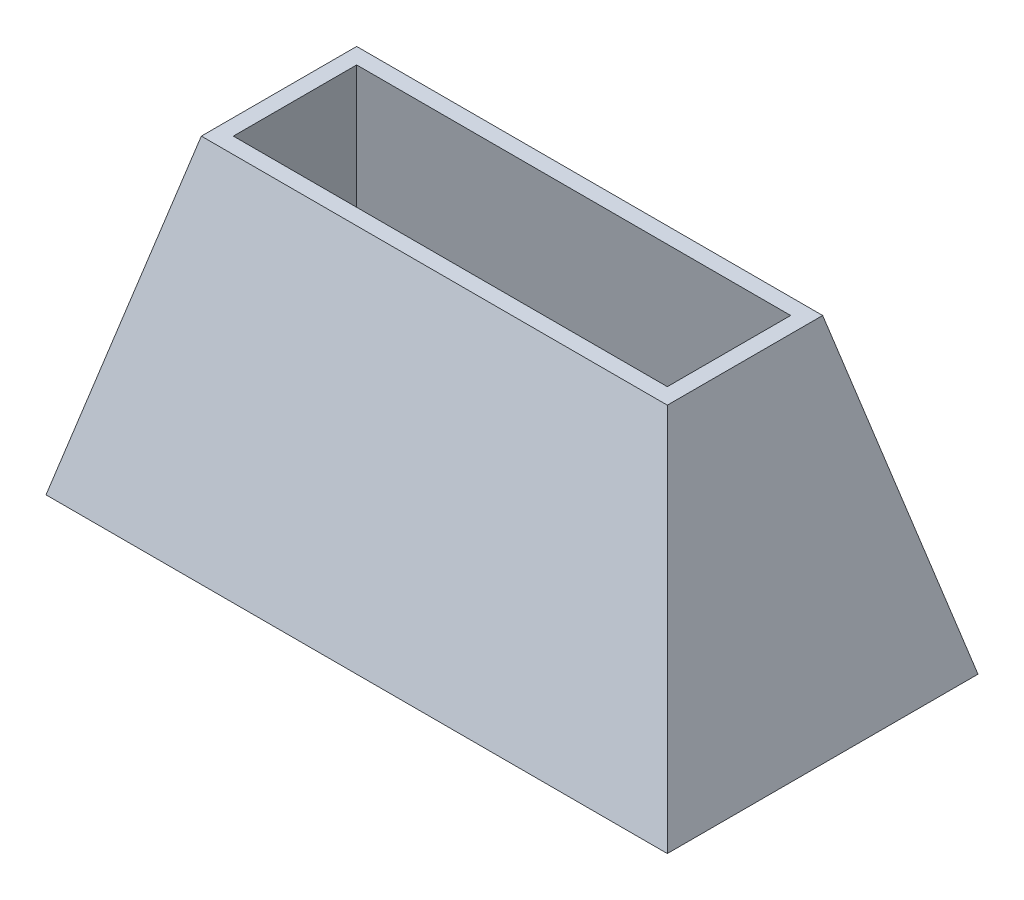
ISO-10303-21;
HEADER;
FILE_DESCRIPTION(('STEP AP214'),'2;1');
FILE_NAME('part.step','',(''),(''),'','','');
FILE_SCHEMA(('AUTOMOTIVE_DESIGN { 1 0 10303 214 1 1 1 1 }'));
ENDSEC;
DATA;
#1=APPLICATION_CONTEXT('core data for automotive mechanical design processes');
#2=APPLICATION_PROTOCOL_DEFINITION('international standard','automotive_design',2000,#1);
#3=PRODUCT_CONTEXT('',#1,'mechanical');
#4=PRODUCT('Part','Part','',(#3));
#5=PRODUCT_RELATED_PRODUCT_CATEGORY('part','',(#4));
#6=PRODUCT_DEFINITION_FORMATION('','',#4);
#7=PRODUCT_DEFINITION_CONTEXT('part definition',#1,'design');
#8=PRODUCT_DEFINITION('design','',#6,#7);
#9=PRODUCT_DEFINITION_SHAPE('','',#8);
#10=(LENGTH_UNIT() NAMED_UNIT(*) SI_UNIT(.MILLI.,.METRE.));
#11=(NAMED_UNIT(*) PLANE_ANGLE_UNIT() SI_UNIT($,.RADIAN.));
#12=(NAMED_UNIT(*) SI_UNIT($,.STERADIAN.) SOLID_ANGLE_UNIT());
#13=UNCERTAINTY_MEASURE_WITH_UNIT(LENGTH_MEASURE(1.E-05),#10,'distance_accuracy_value','');
#14=(GEOMETRIC_REPRESENTATION_CONTEXT(3) GLOBAL_UNCERTAINTY_ASSIGNED_CONTEXT((#13)) GLOBAL_UNIT_ASSIGNED_CONTEXT((#10,
#11,#12)) REPRESENTATION_CONTEXT('',''));
#15=CARTESIAN_POINT('',(0.,0.,0.));
#16=DIRECTION('',(0.,0.,1.));
#17=DIRECTION('',(1.,0.,0.));
#18=AXIS2_PLACEMENT_3D('',#15,#16,#17);
#19=CARTESIAN_POINT('',(0.,50.8,0.));
#20=DIRECTION('',(0.,1.,0.));
#21=DIRECTION('',(0.,0.,1.));
#22=AXIS2_PLACEMENT_3D('',#19,#20,#21);
#23=PLANE('',#22);
#24=DIRECTION('',(-1.,0.,0.));
#25=VECTOR('',#24,1.);
#26=CARTESIAN_POINT('',(0.,50.8,-10.0818279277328));
#27=LINE('',#26,#25);
#28=CARTESIAN_POINT('',(35.4818279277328,50.8,-10.0818279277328));
#29=VERTEX_POINT('',#28);
#30=CARTESIAN_POINT('',(-35.4818279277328,50.8,-10.0818279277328));
#31=VERTEX_POINT('',#30);
#32=EDGE_CURVE('E219',#29,#31,#27,.T.);
#33=ORIENTED_EDGE('',*,*,#32,.F.);
#34=DIRECTION('',(0.,0.,-1.));
#35=VECTOR('',#34,1.);
#36=CARTESIAN_POINT('',(35.4818279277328,50.8,0.));
#37=LINE('',#36,#35);
#38=CARTESIAN_POINT('',(35.4818279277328,50.8,10.0818279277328));
#39=VERTEX_POINT('',#38);
#40=EDGE_CURVE('E222',#39,#29,#37,.T.);
#41=ORIENTED_EDGE('',*,*,#40,.F.);
#42=DIRECTION('',(1.,0.,0.));
#43=VECTOR('',#42,1.);
#44=CARTESIAN_POINT('',(0.,50.8,10.0818279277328));
#45=LINE('',#44,#43);
#46=CARTESIAN_POINT('',(-35.4818279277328,50.8,10.0818279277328));
#47=VERTEX_POINT('',#46);
#48=EDGE_CURVE('E61',#47,#39,#45,.T.);
#49=ORIENTED_EDGE('',*,*,#48,.F.);
#50=DIRECTION('',(0.,0.,1.));
#51=VECTOR('',#50,1.);
#52=CARTESIAN_POINT('',(-35.4818279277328,50.8,0.));
#53=LINE('',#52,#51);
#54=EDGE_CURVE('E216',#31,#47,#53,.T.);
#55=ORIENTED_EDGE('',*,*,#54,.F.);
#56=EDGE_LOOP('',(#33,#41,#49,#55));
#57=FACE_BOUND('',#56,.T.);
#58=DIRECTION('',(-1.,0.,0.));
#59=VECTOR('',#58,1.);
#60=CARTESIAN_POINT('',(38.1,50.8,-12.7));
#61=LINE('',#60,#59);
#62=CARTESIAN_POINT('',(38.1,50.8,-12.7));
#63=VERTEX_POINT('',#62);
#64=CARTESIAN_POINT('',(-38.1,50.8,-12.7));
#65=VERTEX_POINT('',#64);
#66=EDGE_CURVE('E94',#63,#65,#61,.T.);
#67=ORIENTED_EDGE('',*,*,#66,.T.);
#68=DIRECTION('',(0.,0.,1.));
#69=VECTOR('',#68,1.);
#70=CARTESIAN_POINT('',(-38.1,50.8,-12.7));
#71=LINE('',#70,#69);
#72=CARTESIAN_POINT('',(-38.1,50.8,12.7));
#73=VERTEX_POINT('',#72);
#74=EDGE_CURVE('E111',#65,#73,#71,.T.);
#75=ORIENTED_EDGE('',*,*,#74,.T.);
#76=DIRECTION('',(1.,0.,0.));
#77=VECTOR('',#76,1.);
#78=CARTESIAN_POINT('',(-38.1,50.8,12.7));
#79=LINE('',#78,#77);
#80=CARTESIAN_POINT('',(38.1,50.8,12.7));
#81=VERTEX_POINT('',#80);
#82=EDGE_CURVE('E95',#73,#81,#79,.T.);
#83=ORIENTED_EDGE('',*,*,#82,.T.);
#84=DIRECTION('',(0.,0.,-1.));
#85=VECTOR('',#84,1.);
#86=CARTESIAN_POINT('',(38.1,50.8,12.7));
#87=LINE('',#86,#85);
#88=EDGE_CURVE('E90',#81,#63,#87,.T.);
#89=ORIENTED_EDGE('',*,*,#88,.T.);
#90=EDGE_LOOP('',(#67,#75,#83,#89));
#91=FACE_BOUND('',#90,.T.);
#92=ADVANCED_FACE('F43',(#57,#91),#23,.T.);
#93=CARTESIAN_POINT('',(0.,0.,0.));
#94=DIRECTION('',(0.,-1.,0.));
#95=DIRECTION('',(0.,0.,-1.));
#96=AXIS2_PLACEMENT_3D('',#93,#94,#95);
#97=PLANE('',#96);
#98=DIRECTION('',(0.,0.,-1.));
#99=VECTOR('',#98,1.);
#100=CARTESIAN_POINT('',(50.8,0.,25.4));
#101=LINE('',#100,#99);
#102=CARTESIAN_POINT('',(50.8,0.,25.4));
#103=VERTEX_POINT('',#102);
#104=CARTESIAN_POINT('',(50.8,0.,-25.4));
#105=VERTEX_POINT('',#104);
#106=EDGE_CURVE('E118',#103,#105,#101,.T.);
#107=ORIENTED_EDGE('',*,*,#106,.F.);
#108=DIRECTION('',(1.,0.,0.));
#109=VECTOR('',#108,1.);
#110=CARTESIAN_POINT('',(-50.8,0.,25.4));
#111=LINE('',#110,#109);
#112=CARTESIAN_POINT('',(-50.8,0.,25.4));
#113=VERTEX_POINT('',#112);
#114=EDGE_CURVE('E12',#113,#103,#111,.T.);
#115=ORIENTED_EDGE('',*,*,#114,.F.);
#116=DIRECTION('',(0.,0.,1.));
#117=VECTOR('',#116,1.);
#118=CARTESIAN_POINT('',(-50.8,0.,25.4));
#119=LINE('',#118,#117);
#120=CARTESIAN_POINT('',(-50.8,0.,-25.4));
#121=VERTEX_POINT('',#120);
#122=EDGE_CURVE('E53',#121,#113,#119,.T.);
#123=ORIENTED_EDGE('',*,*,#122,.F.);
#124=DIRECTION('',(-1.,0.,0.));
#125=VECTOR('',#124,1.);
#126=CARTESIAN_POINT('',(-50.8,0.,-25.4));
#127=LINE('',#126,#125);
#128=EDGE_CURVE('E133',#105,#121,#127,.T.);
#129=ORIENTED_EDGE('',*,*,#128,.F.);
#130=EDGE_LOOP('',(#107,#115,#123,#129));
#131=FACE_BOUND('',#130,.T.);
#132=ADVANCED_FACE('F277',(#131),#97,.T.);
#133=CARTESIAN_POINT('',(0.,5.97647058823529,23.9058823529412));
#134=DIRECTION('',(0.,-0.242535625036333,-0.970142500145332));
#135=DIRECTION('',(0.,0.970142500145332,-0.242535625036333));
#136=AXIS2_PLACEMENT_3D('',#133,#134,#135);
#137=PLANE('',#136);
#138=DIRECTION('',(-0.235702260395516,0.942809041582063,-0.235702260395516));
#139=VECTOR('',#138,1.);
#140=CARTESIAN_POINT('',(50.8,0.,25.4));
#141=LINE('',#140,#139);
#142=EDGE_CURVE('E70',#103,#81,#141,.T.);
#143=ORIENTED_EDGE('',*,*,#142,.T.);
#144=ORIENTED_EDGE('',*,*,#82,.F.);
#145=DIRECTION('',(0.235702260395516,0.942809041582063,-0.235702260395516));
#146=VECTOR('',#145,1.);
#147=CARTESIAN_POINT('',(-50.8,0.,25.4));
#148=LINE('',#147,#146);
#149=EDGE_CURVE('E121',#113,#73,#148,.T.);
#150=ORIENTED_EDGE('',*,*,#149,.F.);
#151=ORIENTED_EDGE('',*,*,#114,.T.);
#152=EDGE_LOOP('',(#143,#144,#150,#151));
#153=FACE_BOUND('',#152,.T.);
#154=ADVANCED_FACE('F172',(#153),#137,.F.);
#155=CARTESIAN_POINT('',(-47.8117647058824,11.9529411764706,0.));
#156=DIRECTION('',(0.970142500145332,-0.242535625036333,0.));
#157=DIRECTION('',(0.242535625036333,0.970142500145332,0.));
#158=AXIS2_PLACEMENT_3D('',#155,#156,#157);
#159=PLANE('',#158);
#160=ORIENTED_EDGE('',*,*,#149,.T.);
#161=ORIENTED_EDGE('',*,*,#74,.F.);
#162=DIRECTION('',(0.235702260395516,0.942809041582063,0.235702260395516));
#163=VECTOR('',#162,1.);
#164=CARTESIAN_POINT('',(-50.8,0.,-25.4));
#165=LINE('',#164,#163);
#166=EDGE_CURVE('E99',#121,#65,#165,.T.);
#167=ORIENTED_EDGE('',*,*,#166,.F.);
#168=ORIENTED_EDGE('',*,*,#122,.T.);
#169=EDGE_LOOP('',(#160,#161,#167,#168));
#170=FACE_BOUND('',#169,.T.);
#171=ADVANCED_FACE('F163',(#170),#159,.F.);
#172=CARTESIAN_POINT('',(47.8117647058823,11.9529411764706,0.));
#173=DIRECTION('',(-0.970142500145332,-0.242535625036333,0.));
#174=DIRECTION('',(0.242535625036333,-0.970142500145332,0.));
#175=AXIS2_PLACEMENT_3D('',#172,#173,#174);
#176=PLANE('',#175);
#177=DIRECTION('',(-0.235702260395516,0.942809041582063,0.235702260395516));
#178=VECTOR('',#177,1.);
#179=CARTESIAN_POINT('',(50.8,0.,-25.4));
#180=LINE('',#179,#178);
#181=EDGE_CURVE('E109',#105,#63,#180,.T.);
#182=ORIENTED_EDGE('',*,*,#181,.T.);
#183=ORIENTED_EDGE('',*,*,#88,.F.);
#184=ORIENTED_EDGE('',*,*,#142,.F.);
#185=ORIENTED_EDGE('',*,*,#106,.T.);
#186=EDGE_LOOP('',(#182,#183,#184,#185));
#187=FACE_BOUND('',#186,.T.);
#188=ADVANCED_FACE('F116',(#187),#176,.F.);
#189=CARTESIAN_POINT('',(0.,5.97647058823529,-23.9058823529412));
#190=DIRECTION('',(0.,-0.242535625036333,0.970142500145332));
#191=DIRECTION('',(0.,-0.970142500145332,-0.242535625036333));
#192=AXIS2_PLACEMENT_3D('',#189,#190,#191);
#193=PLANE('',#192);
#194=ORIENTED_EDGE('',*,*,#166,.T.);
#195=ORIENTED_EDGE('',*,*,#66,.F.);
#196=ORIENTED_EDGE('',*,*,#181,.F.);
#197=ORIENTED_EDGE('',*,*,#128,.T.);
#198=EDGE_LOOP('',(#194,#195,#196,#197));
#199=FACE_BOUND('',#198,.T.);
#200=ADVANCED_FACE('F107',(#199),#193,.F.);
#201=CARTESIAN_POINT('',(0.,2.54,0.));
#202=DIRECTION('',(0.,-1.,0.));
#203=DIRECTION('',(0.,0.,-1.));
#204=AXIS2_PLACEMENT_3D('',#201,#202,#203);
#205=PLANE('',#204);
#206=DIRECTION('',(0.,0.,-1.));
#207=VECTOR('',#206,1.);
#208=CARTESIAN_POINT('',(47.5468279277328,2.54,0.));
#209=LINE('',#208,#207);
#210=CARTESIAN_POINT('',(47.5468279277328,2.54,22.1468279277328));
#211=VERTEX_POINT('',#210);
#212=CARTESIAN_POINT('',(47.5468279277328,2.54,-22.1468279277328));
#213=VERTEX_POINT('',#212);
#214=EDGE_CURVE('E235',#211,#213,#209,.T.);
#215=ORIENTED_EDGE('',*,*,#214,.T.);
#216=DIRECTION('',(-1.,0.,0.));
#217=VECTOR('',#216,1.);
#218=CARTESIAN_POINT('',(0.,2.54,-22.1468279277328));
#219=LINE('',#218,#217);
#220=CARTESIAN_POINT('',(-47.5468279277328,2.54,-22.1468279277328));
#221=VERTEX_POINT('',#220);
#222=EDGE_CURVE('E237',#213,#221,#219,.T.);
#223=ORIENTED_EDGE('',*,*,#222,.T.);
#224=DIRECTION('',(0.,0.,1.));
#225=VECTOR('',#224,1.);
#226=CARTESIAN_POINT('',(-47.5468279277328,2.54,0.));
#227=LINE('',#226,#225);
#228=CARTESIAN_POINT('',(-47.5468279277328,2.54,22.1468279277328));
#229=VERTEX_POINT('',#228);
#230=EDGE_CURVE('E240',#221,#229,#227,.T.);
#231=ORIENTED_EDGE('',*,*,#230,.T.);
#232=DIRECTION('',(1.,0.,0.));
#233=VECTOR('',#232,1.);
#234=CARTESIAN_POINT('',(0.,2.54,22.1468279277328));
#235=LINE('',#234,#233);
#236=EDGE_CURVE('E112',#229,#211,#235,.T.);
#237=ORIENTED_EDGE('',*,*,#236,.T.);
#238=EDGE_LOOP('',(#215,#223,#231,#237));
#239=FACE_BOUND('',#238,.T.);
#240=ADVANCED_FACE('F144',(#239),#205,.F.);
#241=CARTESIAN_POINT('',(0.,5.36043010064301,21.441720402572));
#242=DIRECTION('',(0.,-0.242535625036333,-0.970142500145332));
#243=DIRECTION('',(0.,0.970142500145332,-0.242535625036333));
#244=AXIS2_PLACEMENT_3D('',#241,#242,#243);
#245=PLANE('',#244);
#246=DIRECTION('',(-0.235702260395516,0.942809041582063,-0.235702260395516));
#247=VECTOR('',#246,1.);
#248=CARTESIAN_POINT('',(44.2394026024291,15.7697013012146,18.8394026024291));
#249=LINE('',#248,#247);
#250=EDGE_CURVE('E230',#211,#39,#249,.T.);
#251=ORIENTED_EDGE('',*,*,#250,.F.);
#252=ORIENTED_EDGE('',*,*,#236,.F.);
#253=DIRECTION('',(0.235702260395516,0.942809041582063,-0.235702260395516));
#254=VECTOR('',#253,1.);
#255=CARTESIAN_POINT('',(-44.2394026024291,15.7697013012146,18.8394026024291));
#256=LINE('',#255,#254);
#257=EDGE_CURVE('E233',#229,#47,#256,.T.);
#258=ORIENTED_EDGE('',*,*,#257,.T.);
#259=ORIENTED_EDGE('',*,*,#48,.T.);
#260=EDGE_LOOP('',(#251,#252,#258,#259));
#261=FACE_BOUND('',#260,.T.);
#262=ADVANCED_FACE('F373',(#261),#245,.T.);
#263=CARTESIAN_POINT('',(-45.3476027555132,11.3369006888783,0.));
#264=DIRECTION('',(0.970142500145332,-0.242535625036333,0.));
#265=DIRECTION('',(0.242535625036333,0.970142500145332,0.));
#266=AXIS2_PLACEMENT_3D('',#263,#264,#265);
#267=PLANE('',#266);
#268=ORIENTED_EDGE('',*,*,#257,.F.);
#269=ORIENTED_EDGE('',*,*,#230,.F.);
#270=DIRECTION('',(0.235702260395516,0.942809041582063,0.235702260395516));
#271=VECTOR('',#270,1.);
#272=CARTESIAN_POINT('',(-44.2394026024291,15.7697013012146,-18.8394026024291));
#273=LINE('',#272,#271);
#274=EDGE_CURVE('E225',#221,#31,#273,.T.);
#275=ORIENTED_EDGE('',*,*,#274,.T.);
#276=ORIENTED_EDGE('',*,*,#54,.T.);
#277=EDGE_LOOP('',(#268,#269,#275,#276));
#278=FACE_BOUND('',#277,.T.);
#279=ADVANCED_FACE('F271',(#278),#267,.T.);
#280=CARTESIAN_POINT('',(45.3476027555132,11.3369006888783,0.));
#281=DIRECTION('',(-0.970142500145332,-0.242535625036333,0.));
#282=DIRECTION('',(0.242535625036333,-0.970142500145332,0.));
#283=AXIS2_PLACEMENT_3D('',#280,#281,#282);
#284=PLANE('',#283);
#285=DIRECTION('',(-0.235702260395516,0.942809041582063,0.235702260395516));
#286=VECTOR('',#285,1.);
#287=CARTESIAN_POINT('',(44.2394026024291,15.7697013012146,-18.8394026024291));
#288=LINE('',#287,#286);
#289=EDGE_CURVE('E227',#213,#29,#288,.T.);
#290=ORIENTED_EDGE('',*,*,#289,.F.);
#291=ORIENTED_EDGE('',*,*,#214,.F.);
#292=ORIENTED_EDGE('',*,*,#250,.T.);
#293=ORIENTED_EDGE('',*,*,#40,.T.);
#294=EDGE_LOOP('',(#290,#291,#292,#293));
#295=FACE_BOUND('',#294,.T.);
#296=ADVANCED_FACE('F257',(#295),#284,.T.);
#297=CARTESIAN_POINT('',(0.,5.36043010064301,-21.441720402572));
#298=DIRECTION('',(0.,-0.242535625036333,0.970142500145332));
#299=DIRECTION('',(0.,-0.970142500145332,-0.242535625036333));
#300=AXIS2_PLACEMENT_3D('',#297,#298,#299);
#301=PLANE('',#300);
#302=ORIENTED_EDGE('',*,*,#274,.F.);
#303=ORIENTED_EDGE('',*,*,#222,.F.);
#304=ORIENTED_EDGE('',*,*,#289,.T.);
#305=ORIENTED_EDGE('',*,*,#32,.T.);
#306=EDGE_LOOP('',(#302,#303,#304,#305));
#307=FACE_BOUND('',#306,.T.);
#308=ADVANCED_FACE('F262',(#307),#301,.T.);
#309=CLOSED_SHELL('',(#92,#132,#154,#171,#188,#200,#240,#262,#279,#296,#308));
#310=MANIFOLD_SOLID_BREP('B2',#309);
#311=ADVANCED_BREP_SHAPE_REPRESENTATION('',(#18,#310),#14);
#312=SHAPE_DEFINITION_REPRESENTATION(#9,#311);
ENDSEC;
END-ISO-10303-21;
